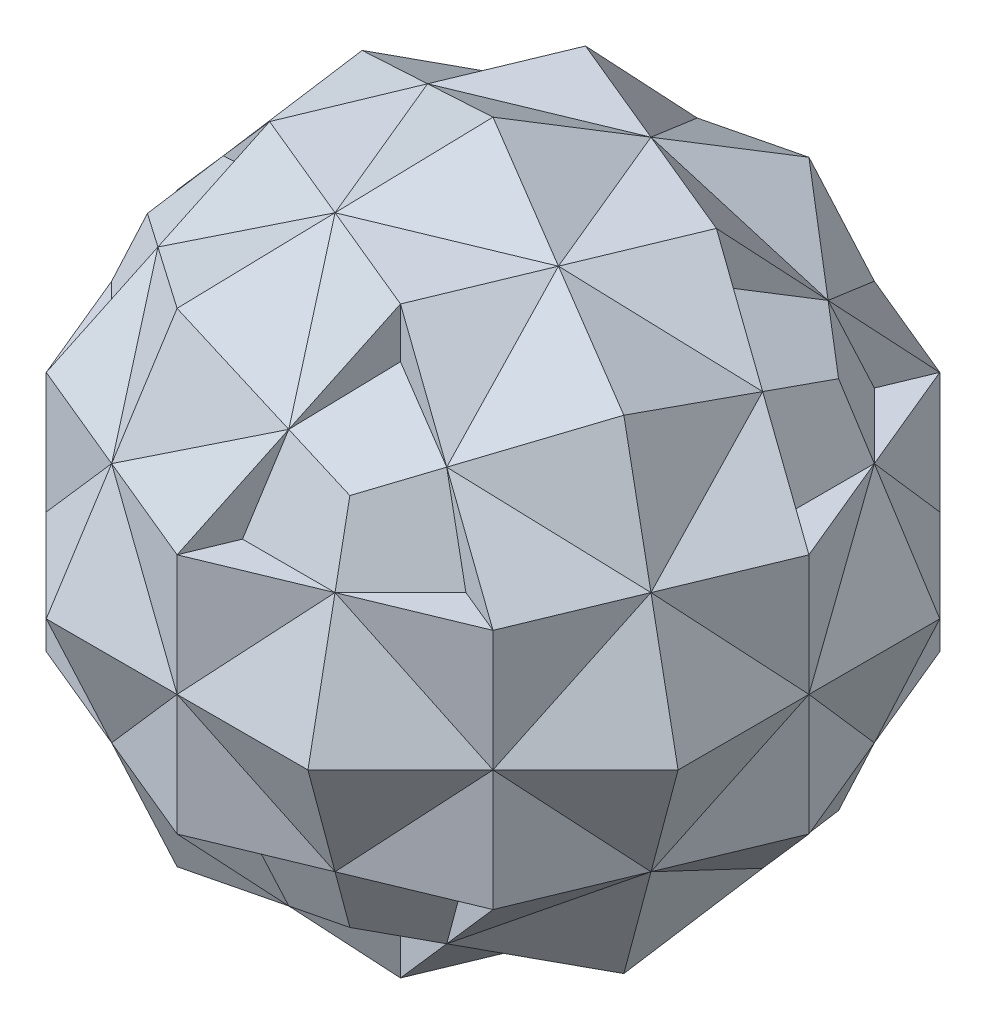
ISO-10303-21;
HEADER;
FILE_DESCRIPTION(('STEP AP214'),'2;1');
FILE_NAME('part.step','',(''),(''),'','','');
FILE_SCHEMA(('AUTOMOTIVE_DESIGN { 1 0 10303 214 1 1 1 1 }'));
ENDSEC;
DATA;
#1=APPLICATION_CONTEXT('core data for automotive mechanical design processes');
#2=APPLICATION_PROTOCOL_DEFINITION('international standard','automotive_design',2000,#1);
#3=PRODUCT_CONTEXT('',#1,'mechanical');
#4=PRODUCT('Part','Part','',(#3));
#5=PRODUCT_RELATED_PRODUCT_CATEGORY('part','',(#4));
#6=PRODUCT_DEFINITION_FORMATION('','',#4);
#7=PRODUCT_DEFINITION_CONTEXT('part definition',#1,'design');
#8=PRODUCT_DEFINITION('design','',#6,#7);
#9=PRODUCT_DEFINITION_SHAPE('','',#8);
#10=(LENGTH_UNIT() NAMED_UNIT(*) SI_UNIT(.MILLI.,.METRE.));
#11=(NAMED_UNIT(*) PLANE_ANGLE_UNIT() SI_UNIT($,.RADIAN.));
#12=(NAMED_UNIT(*) SI_UNIT($,.STERADIAN.) SOLID_ANGLE_UNIT());
#13=UNCERTAINTY_MEASURE_WITH_UNIT(LENGTH_MEASURE(1.E-05),#10,'distance_accuracy_value','');
#14=(GEOMETRIC_REPRESENTATION_CONTEXT(3) GLOBAL_UNCERTAINTY_ASSIGNED_CONTEXT((#13)) GLOBAL_UNIT_ASSIGNED_CONTEXT((#10,
#11,#12)) REPRESENTATION_CONTEXT('',''));
#15=CARTESIAN_POINT('',(0.,0.,0.));
#16=DIRECTION('',(0.,0.,1.));
#17=DIRECTION('',(1.,0.,0.));
#18=AXIS2_PLACEMENT_3D('',#15,#16,#17);
#19=CARTESIAN_POINT('',(-44.680027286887,-40.961563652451,0.829403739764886));
#20=DIRECTION('',(-0.933948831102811,-0.357406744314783,-2.70645488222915E-11));
#21=DIRECTION('',(0.357406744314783,-0.933948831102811,0.));
#22=AXIS2_PLACEMENT_3D('',#19,#20,#21);
#23=PLANE('',#22);
#24=DIRECTION('',(-0.353553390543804,0.923879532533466,0.146446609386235));
#25=VECTOR('',#24,1.);
#26=CARTESIAN_POINT('',(-53.5188620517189,-17.8645753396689,22.1682385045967));
#27=LINE('',#26,#25);
#28=CARTESIAN_POINT('',(-46.6823850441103,-35.7291506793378,19.3364770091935));
#29=VERTEX_POINT('',#28);
#30=CARTESIAN_POINT('',(-60.3553390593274,0.,25.));
#31=VERTEX_POINT('',#30);
#32=EDGE_CURVE('E918',#29,#31,#27,.T.);
#33=ORIENTED_EDGE('',*,*,#32,.T.);
#34=DIRECTION('',(0.,0.,-1.));
#35=VECTOR('',#34,1.);
#36=CARTESIAN_POINT('',(-60.3553390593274,0.,0.));
#37=LINE('',#36,#35);
#38=CARTESIAN_POINT('',(-60.3553390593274,0.,-25.));
#39=VERTEX_POINT('',#38);
#40=EDGE_CURVE('E920',#31,#39,#37,.T.);
#41=ORIENTED_EDGE('',*,*,#40,.T.);
#42=DIRECTION('',(0.353553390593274,-0.923879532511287,0.146446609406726));
#43=VECTOR('',#42,1.);
#44=CARTESIAN_POINT('',(-51.5165042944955,-23.0969883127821,-21.3388347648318));
#45=LINE('',#44,#43);
#46=CARTESIAN_POINT('',(-42.6776695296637,-46.1939766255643,-17.6776695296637));
#47=VERTEX_POINT('',#46);
#48=EDGE_CURVE('E922',#39,#47,#45,.T.);
#49=ORIENTED_EDGE('',*,*,#48,.T.);
#50=DIRECTION('',(-0.103553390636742,0.270598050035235,0.957106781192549));
#51=VECTOR('',#50,1.);
#52=CARTESIAN_POINT('',(-44.680027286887,-40.961563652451,0.829403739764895));
#53=LINE('',#52,#51);
#54=EDGE_CURVE('E695',#47,#29,#53,.T.);
#55=ORIENTED_EDGE('',*,*,#54,.T.);
#56=EDGE_LOOP('',(#33,#41,#49,#55));
#57=FACE_BOUND('',#56,.T.);
#58=ADVANCED_FACE('F692',(#57),#23,.T.);
#59=CARTESIAN_POINT('',(-51.5165042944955,-23.0969883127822,-21.3388347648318));
#60=DIRECTION('',(0.660401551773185,0.357406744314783,0.660401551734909));
#61=DIRECTION('',(0.707106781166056,0.,-0.707106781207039));
#62=AXIS2_PLACEMENT_3D('',#59,#60,#61);
#63=PLANE('',#62);
#64=ORIENTED_EDGE('',*,*,#48,.F.);
#65=DIRECTION('',(-0.707106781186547,0.,0.707106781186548));
#66=VECTOR('',#65,1.);
#67=CARTESIAN_POINT('',(-42.6776695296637,0.,-42.6776695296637));
#68=LINE('',#67,#66);
#69=CARTESIAN_POINT('',(-25.,0.,-60.3553390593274));
#70=VERTEX_POINT('',#69);
#71=EDGE_CURVE('E902',#70,#39,#68,.T.);
#72=ORIENTED_EDGE('',*,*,#71,.F.);
#73=DIRECTION('',(-0.146446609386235,0.923879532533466,-0.353553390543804));
#74=VECTOR('',#73,1.);
#75=CARTESIAN_POINT('',(-22.1682385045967,-17.8645753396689,-53.5188620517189));
#76=LINE('',#75,#74);
#77=CARTESIAN_POINT('',(-19.3364770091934,-35.7291506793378,-46.6823850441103));
#78=VERTEX_POINT('',#77);
#79=EDGE_CURVE('E899',#78,#70,#76,.T.);
#80=ORIENTED_EDGE('',*,*,#79,.F.);
#81=DIRECTION('',(0.603553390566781,0.270598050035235,-0.750000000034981));
#82=VECTOR('',#81,1.);
#83=CARTESIAN_POINT('',(-31.0070732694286,-40.961563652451,-32.180027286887));
#84=LINE('',#83,#82);
#85=EDGE_CURVE('E897',#47,#78,#84,.T.);
#86=ORIENTED_EDGE('',*,*,#85,.F.);
#87=EDGE_LOOP('',(#64,#72,#80,#86));
#88=FACE_BOUND('',#87,.T.);
#89=ADVANCED_FACE('F946',(#88),#63,.F.);
#90=CARTESIAN_POINT('',(21.3388347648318,-23.0969883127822,-51.5165042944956));
#91=DIRECTION('',(-2.70644780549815E-11,0.357406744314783,0.933948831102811));
#92=DIRECTION('',(0.,-0.933948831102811,0.357406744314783));
#93=AXIS2_PLACEMENT_3D('',#90,#91,#92);
#94=PLANE('',#93);
#95=ORIENTED_EDGE('',*,*,#79,.T.);
#96=DIRECTION('',(-1.,0.,0.));
#97=VECTOR('',#96,1.);
#98=CARTESIAN_POINT('',(0.,0.,-60.3553390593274));
#99=LINE('',#98,#97);
#100=CARTESIAN_POINT('',(25.,0.,-60.3553390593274));
#101=VERTEX_POINT('',#100);
#102=EDGE_CURVE('E886',#101,#70,#99,.T.);
#103=ORIENTED_EDGE('',*,*,#102,.F.);
#104=DIRECTION('',(0.146446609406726,0.923879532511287,-0.353553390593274));
#105=VECTOR('',#104,1.);
#106=CARTESIAN_POINT('',(21.3388347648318,-23.0969883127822,-51.5165042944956));
#107=LINE('',#106,#105);
#108=CARTESIAN_POINT('',(17.6776695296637,-46.1939766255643,-42.6776695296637));
#109=VERTEX_POINT('',#108);
#110=EDGE_CURVE('E883',#109,#101,#107,.T.);
#111=ORIENTED_EDGE('',*,*,#110,.F.);
#112=DIRECTION('',(0.95710678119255,-0.270598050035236,0.103553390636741));
#113=VECTOR('',#112,1.);
#114=CARTESIAN_POINT('',(-0.829403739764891,-40.961563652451,-44.680027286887));
#115=LINE('',#114,#113);
#116=EDGE_CURVE('E823',#78,#109,#115,.T.);
#117=ORIENTED_EDGE('',*,*,#116,.F.);
#118=EDGE_LOOP('',(#95,#103,#111,#117));
#119=FACE_BOUND('',#118,.T.);
#120=ADVANCED_FACE('F950',(#119),#94,.F.);
#121=CARTESIAN_POINT('',(21.3388347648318,-23.0969883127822,-51.5165042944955));
#122=DIRECTION('',(-0.66040155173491,0.357406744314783,0.660401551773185));
#123=DIRECTION('',(0.707106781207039,0.,0.707106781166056));
#124=AXIS2_PLACEMENT_3D('',#121,#122,#123);
#125=PLANE('',#124);
#126=ORIENTED_EDGE('',*,*,#110,.T.);
#127=DIRECTION('',(-0.707106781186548,0.,-0.707106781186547));
#128=VECTOR('',#127,1.);
#129=CARTESIAN_POINT('',(42.6776695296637,0.,-42.6776695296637));
#130=LINE('',#129,#128);
#131=CARTESIAN_POINT('',(60.3553390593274,0.,-25.));
#132=VERTEX_POINT('',#131);
#133=EDGE_CURVE('E871',#132,#101,#130,.T.);
#134=ORIENTED_EDGE('',*,*,#133,.F.);
#135=DIRECTION('',(0.353553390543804,0.923879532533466,-0.146446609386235));
#136=VECTOR('',#135,1.);
#137=CARTESIAN_POINT('',(53.5188620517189,-17.8645753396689,-22.1682385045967));
#138=LINE('',#137,#136);
#139=CARTESIAN_POINT('',(46.6823850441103,-35.7291506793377,-19.3364770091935));
#140=VERTEX_POINT('',#139);
#141=EDGE_CURVE('E868',#140,#132,#138,.T.);
#142=ORIENTED_EDGE('',*,*,#141,.F.);
#143=DIRECTION('',(0.75000000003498,0.270598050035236,0.603553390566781));
#144=VECTOR('',#143,1.);
#145=CARTESIAN_POINT('',(32.180027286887,-40.961563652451,-31.0070732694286));
#146=LINE('',#145,#144);
#147=EDGE_CURVE('E865',#109,#140,#146,.T.);
#148=ORIENTED_EDGE('',*,*,#147,.F.);
#149=EDGE_LOOP('',(#126,#134,#142,#148));
#150=FACE_BOUND('',#149,.T.);
#151=ADVANCED_FACE('F953',(#150),#125,.F.);
#152=CARTESIAN_POINT('',(0.,0.,60.3553390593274));
#153=DIRECTION('',(-2.70608610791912E-11,0.357406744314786,0.93394883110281));
#154=DIRECTION('',(0.,-0.93394883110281,0.357406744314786));
#155=AXIS2_PLACEMENT_3D('',#152,#153,#154);
#156=PLANE('',#155);
#157=DIRECTION('',(1.,0.,0.));
#158=VECTOR('',#157,1.);
#159=CARTESIAN_POINT('',(0.,0.,60.3553390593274));
#160=LINE('',#159,#158);
#161=CARTESIAN_POINT('',(-25.,0.,60.3553390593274));
#162=VERTEX_POINT('',#161);
#163=CARTESIAN_POINT('',(25.,0.,60.3553390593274));
#164=VERTEX_POINT('',#163);
#165=EDGE_CURVE('E889',#162,#164,#160,.T.);
#166=ORIENTED_EDGE('',*,*,#165,.T.);
#167=DIRECTION('',(0.146446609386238,-0.923879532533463,0.35355339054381));
#168=VECTOR('',#167,1.);
#169=CARTESIAN_POINT('',(22.1682385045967,17.8645753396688,53.5188620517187));
#170=LINE('',#169,#168);
#171=CARTESIAN_POINT('',(19.3364770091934,35.7291506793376,46.6823850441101));
#172=VERTEX_POINT('',#171);
#173=EDGE_CURVE('E882',#172,#164,#170,.T.);
#174=ORIENTED_EDGE('',*,*,#173,.F.);
#175=DIRECTION('',(-0.957106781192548,0.270598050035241,-0.103553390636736));
#176=VECTOR('',#175,1.);
#177=CARTESIAN_POINT('',(0.829403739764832,40.961563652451,44.6800272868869));
#178=LINE('',#177,#176);
#179=CARTESIAN_POINT('',(-17.6776695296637,46.1939766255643,42.6776695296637));
#180=VERTEX_POINT('',#179);
#181=EDGE_CURVE('E892',#172,#180,#178,.T.);
#182=ORIENTED_EDGE('',*,*,#181,.T.);
#183=DIRECTION('',(-0.146446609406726,-0.923879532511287,0.353553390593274));
#184=VECTOR('',#183,1.);
#185=CARTESIAN_POINT('',(-21.3388347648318,23.0969883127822,51.5165042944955));
#186=LINE('',#185,#184);
#187=EDGE_CURVE('E867',#180,#162,#186,.T.);
#188=ORIENTED_EDGE('',*,*,#187,.T.);
#189=EDGE_LOOP('',(#166,#174,#182,#188));
#190=FACE_BOUND('',#189,.T.);
#191=ADVANCED_FACE('F977',(#190),#156,.T.);
#192=CARTESIAN_POINT('',(-53.5188620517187,17.8645753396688,22.1682385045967));
#193=DIRECTION('',(-0.660401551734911,0.357406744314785,0.660401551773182));
#194=DIRECTION('',(0.707106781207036,0.,0.707106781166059));
#195=AXIS2_PLACEMENT_3D('',#192,#193,#194);
#196=PLANE('',#195);
#197=DIRECTION('',(0.707106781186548,0.,0.707106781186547));
#198=VECTOR('',#197,1.);
#199=CARTESIAN_POINT('',(-42.6776695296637,0.,42.6776695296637));
#200=LINE('',#199,#198);
#201=EDGE_CURVE('E873',#31,#162,#200,.T.);
#202=ORIENTED_EDGE('',*,*,#201,.T.);
#203=ORIENTED_EDGE('',*,*,#187,.F.);
#204=DIRECTION('',(-0.750000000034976,-0.270598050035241,-0.603553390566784));
#205=VECTOR('',#204,1.);
#206=CARTESIAN_POINT('',(-32.1800272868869,40.961563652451,31.0070732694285));
#207=LINE('',#206,#205);
#208=CARTESIAN_POINT('',(-46.6823850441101,35.7291506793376,19.3364770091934));
#209=VERTEX_POINT('',#208);
#210=EDGE_CURVE('E876',#180,#209,#207,.T.);
#211=ORIENTED_EDGE('',*,*,#210,.T.);
#212=DIRECTION('',(-0.35355339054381,-0.923879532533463,0.146446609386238));
#213=VECTOR('',#212,1.);
#214=CARTESIAN_POINT('',(-53.5188620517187,17.8645753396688,22.1682385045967));
#215=LINE('',#214,#213);
#216=EDGE_CURVE('E857',#209,#31,#215,.T.);
#217=ORIENTED_EDGE('',*,*,#216,.T.);
#218=EDGE_LOOP('',(#202,#203,#211,#217));
#219=FACE_BOUND('',#218,.T.);
#220=ADVANCED_FACE('F933',(#219),#196,.T.);
#221=CARTESIAN_POINT('',(22.1682385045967,17.8645753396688,53.5188620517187));
#222=DIRECTION('',(0.660401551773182,0.357406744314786,0.660401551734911));
#223=DIRECTION('',(0.707106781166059,0.,-0.707106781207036));
#224=AXIS2_PLACEMENT_3D('',#221,#222,#223);
#225=PLANE('',#224);
#226=DIRECTION('',(0.707106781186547,0.,-0.707106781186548));
#227=VECTOR('',#226,1.);
#228=CARTESIAN_POINT('',(42.6776695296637,0.,42.6776695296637));
#229=LINE('',#228,#227);
#230=CARTESIAN_POINT('',(60.3553390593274,0.,25.));
#231=VERTEX_POINT('',#230);
#232=EDGE_CURVE('E904',#164,#231,#229,.T.);
#233=ORIENTED_EDGE('',*,*,#232,.T.);
#234=DIRECTION('',(-0.353553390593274,0.923879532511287,-0.146446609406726));
#235=VECTOR('',#234,1.);
#236=CARTESIAN_POINT('',(51.5165042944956,23.0969883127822,21.3388347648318));
#237=LINE('',#236,#235);
#238=CARTESIAN_POINT('',(42.6776695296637,46.1939766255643,17.6776695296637));
#239=VERTEX_POINT('',#238);
#240=EDGE_CURVE('E13',#231,#239,#237,.T.);
#241=ORIENTED_EDGE('',*,*,#240,.T.);
#242=DIRECTION('',(-0.603553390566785,-0.27059805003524,0.750000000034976));
#243=VECTOR('',#242,1.);
#244=CARTESIAN_POINT('',(31.0070732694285,40.9615636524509,32.1800272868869));
#245=LINE('',#244,#243);
#246=EDGE_CURVE('E907',#239,#172,#245,.T.);
#247=ORIENTED_EDGE('',*,*,#246,.T.);
#248=ORIENTED_EDGE('',*,*,#173,.T.);
#249=EDGE_LOOP('',(#233,#241,#247,#248));
#250=FACE_BOUND('',#249,.T.);
#251=ADVANCED_FACE('F976',(#250),#225,.T.);
#252=CARTESIAN_POINT('',(60.3553390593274,0.,0.));
#253=DIRECTION('',(-0.933948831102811,-0.357406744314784,-2.70630045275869E-11));
#254=DIRECTION('',(0.357406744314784,-0.933948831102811,0.));
#255=AXIS2_PLACEMENT_3D('',#252,#253,#254);
#256=PLANE('',#255);
#257=DIRECTION('',(0.,0.,1.));
#258=VECTOR('',#257,1.);
#259=CARTESIAN_POINT('',(60.3553390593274,0.,0.));
#260=LINE('',#259,#258);
#261=EDGE_CURVE('E916',#132,#231,#260,.T.);
#262=ORIENTED_EDGE('',*,*,#261,.F.);
#263=DIRECTION('',(0.353553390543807,-0.923879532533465,-0.146446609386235));
#264=VECTOR('',#263,1.);
#265=CARTESIAN_POINT('',(53.5188620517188,17.8645753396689,-22.1682385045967));
#266=LINE('',#265,#264);
#267=CARTESIAN_POINT('',(46.6823850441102,35.7291506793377,-19.3364770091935));
#268=VERTEX_POINT('',#267);
#269=EDGE_CURVE('E914',#268,#132,#266,.T.);
#270=ORIENTED_EDGE('',*,*,#269,.F.);
#271=DIRECTION('',(0.103553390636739,-0.270598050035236,-0.95710678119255));
#272=VECTOR('',#271,1.);
#273=CARTESIAN_POINT('',(44.680027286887,40.961563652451,-0.829403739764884));
#274=LINE('',#273,#272);
#275=EDGE_CURVE('E700',#239,#268,#274,.T.);
#276=ORIENTED_EDGE('',*,*,#275,.F.);
#277=ORIENTED_EDGE('',*,*,#240,.F.);
#278=EDGE_LOOP('',(#262,#270,#276,#277));
#279=FACE_BOUND('',#278,.T.);
#280=ADVANCED_FACE('F964',(#279),#256,.F.);
#281=CARTESIAN_POINT('',(-51.5165042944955,23.0969883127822,-21.3388347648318));
#282=DIRECTION('',(-0.93394883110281,0.357406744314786,-2.70611267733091E-11));
#283=DIRECTION('',(-0.357406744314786,-0.93394883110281,0.));
#284=AXIS2_PLACEMENT_3D('',#281,#282,#283);
#285=PLANE('',#284);
#286=ORIENTED_EDGE('',*,*,#40,.F.);
#287=ORIENTED_EDGE('',*,*,#216,.F.);
#288=DIRECTION('',(0.103553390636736,0.27059805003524,-0.957106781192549));
#289=VECTOR('',#288,1.);
#290=CARTESIAN_POINT('',(-44.6800272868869,40.961563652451,0.829403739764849));
#291=LINE('',#290,#289);
#292=CARTESIAN_POINT('',(-42.6776695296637,46.1939766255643,-17.6776695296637));
#293=VERTEX_POINT('',#292);
#294=EDGE_CURVE('E860',#209,#293,#291,.T.);
#295=ORIENTED_EDGE('',*,*,#294,.T.);
#296=DIRECTION('',(-0.353553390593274,-0.923879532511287,-0.146446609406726));
#297=VECTOR('',#296,1.);
#298=CARTESIAN_POINT('',(-51.5165042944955,23.0969883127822,-21.3388347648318));
#299=LINE('',#298,#297);
#300=EDGE_CURVE('E848',#293,#39,#299,.T.);
#301=ORIENTED_EDGE('',*,*,#300,.T.);
#302=EDGE_LOOP('',(#286,#287,#295,#301));
#303=FACE_BOUND('',#302,.T.);
#304=ADVANCED_FACE('F938',(#303),#285,.T.);
#305=CARTESIAN_POINT('',(60.3553390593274,0.,0.));
#306=DIRECTION('',(-0.933948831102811,0.357406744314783,-2.70643935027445E-11));
#307=DIRECTION('',(-0.357406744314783,-0.933948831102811,0.));
#308=AXIS2_PLACEMENT_3D('',#305,#306,#307);
#309=PLANE('',#308);
#310=ORIENTED_EDGE('',*,*,#141,.T.);
#311=ORIENTED_EDGE('',*,*,#261,.T.);
#312=DIRECTION('',(0.353553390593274,0.923879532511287,0.146446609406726));
#313=VECTOR('',#312,1.);
#314=CARTESIAN_POINT('',(51.5165042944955,-23.0969883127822,21.3388347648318));
#315=LINE('',#314,#313);
#316=CARTESIAN_POINT('',(42.6776695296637,-46.1939766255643,17.6776695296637));
#317=VERTEX_POINT('',#316);
#318=EDGE_CURVE('E858',#317,#231,#315,.T.);
#319=ORIENTED_EDGE('',*,*,#318,.F.);
#320=DIRECTION('',(-0.103553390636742,-0.270598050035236,0.957106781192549));
#321=VECTOR('',#320,1.);
#322=CARTESIAN_POINT('',(44.680027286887,-40.961563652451,-0.829403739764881));
#323=LINE('',#322,#321);
#324=EDGE_CURVE('E798',#140,#317,#323,.T.);
#325=ORIENTED_EDGE('',*,*,#324,.F.);
#326=EDGE_LOOP('',(#310,#311,#319,#325));
#327=FACE_BOUND('',#326,.T.);
#328=ADVANCED_FACE('F982',(#327),#309,.F.);
#329=CARTESIAN_POINT('',(42.6776695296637,0.,42.6776695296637));
#330=DIRECTION('',(-0.660401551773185,0.357406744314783,-0.66040155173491));
#331=DIRECTION('',(-0.707106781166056,0.,0.707106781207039));
#332=AXIS2_PLACEMENT_3D('',#329,#330,#331);
#333=PLANE('',#332);
#334=ORIENTED_EDGE('',*,*,#318,.T.);
#335=ORIENTED_EDGE('',*,*,#232,.F.);
#336=DIRECTION('',(0.146446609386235,0.923879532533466,0.353553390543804));
#337=VECTOR('',#336,1.);
#338=CARTESIAN_POINT('',(22.1682385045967,-17.8645753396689,53.5188620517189));
#339=LINE('',#338,#337);
#340=CARTESIAN_POINT('',(19.3364770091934,-35.7291506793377,46.6823850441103));
#341=VERTEX_POINT('',#340);
#342=EDGE_CURVE('E849',#341,#164,#339,.T.);
#343=ORIENTED_EDGE('',*,*,#342,.F.);
#344=DIRECTION('',(-0.603553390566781,0.270598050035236,0.75000000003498));
#345=VECTOR('',#344,1.);
#346=CARTESIAN_POINT('',(31.0070732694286,-40.961563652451,32.180027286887));
#347=LINE('',#346,#345);
#348=EDGE_CURVE('E716',#317,#341,#347,.T.);
#349=ORIENTED_EDGE('',*,*,#348,.F.);
#350=EDGE_LOOP('',(#334,#335,#343,#349));
#351=FACE_BOUND('',#350,.T.);
#352=ADVANCED_FACE('F980',(#351),#333,.F.);
#353=CARTESIAN_POINT('',(-31.0070732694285,40.961563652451,-32.1800272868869));
#354=DIRECTION('',(-0.660401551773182,0.357406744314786,-0.660401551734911));
#355=DIRECTION('',(-0.707106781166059,0.,0.707106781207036));
#356=AXIS2_PLACEMENT_3D('',#353,#354,#355);
#357=PLANE('',#356);
#358=ORIENTED_EDGE('',*,*,#71,.T.);
#359=ORIENTED_EDGE('',*,*,#300,.F.);
#360=DIRECTION('',(0.603553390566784,-0.27059805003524,-0.750000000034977));
#361=VECTOR('',#360,1.);
#362=CARTESIAN_POINT('',(-31.0070732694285,40.961563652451,-32.1800272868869));
#363=LINE('',#362,#361);
#364=CARTESIAN_POINT('',(-19.3364770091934,35.7291506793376,-46.6823850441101));
#365=VERTEX_POINT('',#364);
#366=EDGE_CURVE('E852',#293,#365,#363,.T.);
#367=ORIENTED_EDGE('',*,*,#366,.T.);
#368=DIRECTION('',(-0.146446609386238,-0.923879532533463,-0.35355339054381));
#369=VECTOR('',#368,1.);
#370=CARTESIAN_POINT('',(-22.1682385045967,17.8645753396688,-53.5188620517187));
#371=LINE('',#370,#369);
#372=EDGE_CURVE('E838',#365,#70,#371,.T.);
#373=ORIENTED_EDGE('',*,*,#372,.T.);
#374=EDGE_LOOP('',(#358,#359,#367,#373));
#375=FACE_BOUND('',#374,.T.);
#376=ADVANCED_FACE('F941',(#375),#357,.T.);
#377=CARTESIAN_POINT('',(21.3388347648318,23.0969883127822,-51.5165042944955));
#378=DIRECTION('',(2.70613215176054E-11,0.357406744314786,-0.93394883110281));
#379=DIRECTION('',(0.,0.93394883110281,0.357406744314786));
#380=AXIS2_PLACEMENT_3D('',#377,#378,#379);
#381=PLANE('',#380);
#382=ORIENTED_EDGE('',*,*,#102,.T.);
#383=ORIENTED_EDGE('',*,*,#372,.F.);
#384=DIRECTION('',(0.957106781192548,0.270598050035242,0.103553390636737));
#385=VECTOR('',#384,1.);
#386=CARTESIAN_POINT('',(-0.829403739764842,40.961563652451,-44.6800272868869));
#387=LINE('',#386,#385);
#388=CARTESIAN_POINT('',(17.6776695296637,46.1939766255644,-42.6776695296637));
#389=VERTEX_POINT('',#388);
#390=EDGE_CURVE('E842',#365,#389,#387,.T.);
#391=ORIENTED_EDGE('',*,*,#390,.T.);
#392=DIRECTION('',(0.146446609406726,-0.923879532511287,-0.353553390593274));
#393=VECTOR('',#392,1.);
#394=CARTESIAN_POINT('',(21.3388347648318,23.0969883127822,-51.5165042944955));
#395=LINE('',#394,#393);
#396=EDGE_CURVE('E835',#389,#101,#395,.T.);
#397=ORIENTED_EDGE('',*,*,#396,.T.);
#398=EDGE_LOOP('',(#382,#383,#391,#397));
#399=FACE_BOUND('',#398,.T.);
#400=ADVANCED_FACE('F957',(#399),#381,.T.);
#401=CARTESIAN_POINT('',(22.1682385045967,-17.8645753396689,53.5188620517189));
#402=DIRECTION('',(2.70641781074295E-11,0.357406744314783,-0.933948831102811));
#403=DIRECTION('',(0.,0.933948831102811,0.357406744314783));
#404=AXIS2_PLACEMENT_3D('',#401,#402,#403);
#405=PLANE('',#404);
#406=ORIENTED_EDGE('',*,*,#342,.T.);
#407=ORIENTED_EDGE('',*,*,#165,.F.);
#408=DIRECTION('',(-0.146446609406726,0.923879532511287,0.353553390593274));
#409=VECTOR('',#408,1.);
#410=CARTESIAN_POINT('',(-21.3388347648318,-23.0969883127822,51.5165042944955));
#411=LINE('',#410,#409);
#412=CARTESIAN_POINT('',(-17.6776695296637,-46.1939766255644,42.6776695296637));
#413=VERTEX_POINT('',#412);
#414=EDGE_CURVE('E839',#413,#162,#411,.T.);
#415=ORIENTED_EDGE('',*,*,#414,.F.);
#416=DIRECTION('',(-0.957106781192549,-0.270598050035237,-0.103553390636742));
#417=VECTOR('',#416,1.);
#418=CARTESIAN_POINT('',(0.829403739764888,-40.961563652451,44.680027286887));
#419=LINE('',#418,#417);
#420=EDGE_CURVE('E818',#341,#413,#419,.T.);
#421=ORIENTED_EDGE('',*,*,#420,.F.);
#422=EDGE_LOOP('',(#406,#407,#415,#421));
#423=FACE_BOUND('',#422,.T.);
#424=ADVANCED_FACE('F979',(#423),#405,.F.);
#425=CARTESIAN_POINT('',(-21.3388347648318,-23.0969883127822,51.5165042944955));
#426=DIRECTION('',(0.66040155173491,0.357406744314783,-0.660401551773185));
#427=DIRECTION('',(-0.707106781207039,0.,-0.707106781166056));
#428=AXIS2_PLACEMENT_3D('',#425,#426,#427);
#429=PLANE('',#428);
#430=ORIENTED_EDGE('',*,*,#414,.T.);
#431=ORIENTED_EDGE('',*,*,#201,.F.);
#432=ORIENTED_EDGE('',*,*,#32,.F.);
#433=DIRECTION('',(-0.750000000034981,0.270598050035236,-0.60355339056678));
#434=VECTOR('',#433,1.);
#435=CARTESIAN_POINT('',(-32.180027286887,-40.9615636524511,31.0070732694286));
#436=LINE('',#435,#434);
#437=EDGE_CURVE('E833',#413,#29,#436,.T.);
#438=ORIENTED_EDGE('',*,*,#437,.F.);
#439=EDGE_LOOP('',(#430,#431,#432,#438));
#440=FACE_BOUND('',#439,.T.);
#441=ADVANCED_FACE('F930',(#440),#429,.F.);
#442=CARTESIAN_POINT('',(32.1800272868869,40.961563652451,-31.0070732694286));
#443=DIRECTION('',(0.66040155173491,0.357406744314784,-0.660401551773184));
#444=DIRECTION('',(-0.707106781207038,0.,-0.707106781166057));
#445=AXIS2_PLACEMENT_3D('',#442,#443,#444);
#446=PLANE('',#445);
#447=ORIENTED_EDGE('',*,*,#133,.T.);
#448=ORIENTED_EDGE('',*,*,#396,.F.);
#449=DIRECTION('',(0.75000000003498,-0.270598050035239,0.603553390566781));
#450=VECTOR('',#449,1.);
#451=CARTESIAN_POINT('',(32.180027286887,40.961563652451,-31.0070732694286));
#452=LINE('',#451,#450);
#453=EDGE_CURVE('E819',#389,#268,#452,.T.);
#454=ORIENTED_EDGE('',*,*,#453,.T.);
#455=ORIENTED_EDGE('',*,*,#269,.T.);
#456=EDGE_LOOP('',(#447,#448,#454,#455));
#457=FACE_BOUND('',#456,.T.);
#458=ADVANCED_FACE('F960',(#457),#446,.T.);
#459=CARTESIAN_POINT('',(44.680027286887,40.961563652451,-0.829403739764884));
#460=DIRECTION('',(0.466974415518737,0.862856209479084,-0.19342713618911));
#461=DIRECTION('',(-0.879465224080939,0.475963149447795,0.));
#462=AXIS2_PLACEMENT_3D('',#459,#460,#461);
#463=PLANE('',#462);
#464=ORIENTED_EDGE('',*,*,#275,.T.);
#465=ORIENTED_EDGE('',*,*,#453,.F.);
#466=DIRECTION('',(-0.353553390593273,0.38268343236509,0.853553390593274));
#467=VECTOR('',#466,1.);
#468=CARTESIAN_POINT('',(8.83883476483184,55.7610624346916,-21.3388347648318));
#469=LINE('',#468,#467);
#470=CARTESIAN_POINT('',(0.,65.3281482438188,0.));
#471=VERTEX_POINT('',#470);
#472=EDGE_CURVE('E814',#389,#471,#469,.T.);
#473=ORIENTED_EDGE('',*,*,#472,.T.);
#474=DIRECTION('',(0.853553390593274,-0.38268343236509,0.353553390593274));
#475=VECTOR('',#474,1.);
#476=CARTESIAN_POINT('',(21.3388347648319,55.7610624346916,8.83883476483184));
#477=LINE('',#476,#475);
#478=EDGE_CURVE('E708',#471,#239,#477,.T.);
#479=ORIENTED_EDGE('',*,*,#478,.T.);
#480=EDGE_LOOP('',(#464,#465,#473,#479));
#481=FACE_BOUND('',#480,.T.);
#482=ADVANCED_FACE('F967',(#481),#463,.T.);
#483=CARTESIAN_POINT('',(-32.180027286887,-40.9615636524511,31.0070732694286));
#484=DIRECTION('',(0.466974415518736,0.862856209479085,-0.193427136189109));
#485=DIRECTION('',(-0.87946522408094,0.475963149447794,0.));
#486=AXIS2_PLACEMENT_3D('',#483,#484,#485);
#487=PLANE('',#486);
#488=ORIENTED_EDGE('',*,*,#437,.T.);
#489=ORIENTED_EDGE('',*,*,#54,.F.);
#490=DIRECTION('',(-0.853553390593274,0.38268343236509,-0.353553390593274));
#491=VECTOR('',#490,1.);
#492=CARTESIAN_POINT('',(-21.3388347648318,-55.7610624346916,-8.83883476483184));
#493=LINE('',#492,#491);
#494=CARTESIAN_POINT('',(0.,-65.3281482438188,0.));
#495=VERTEX_POINT('',#494);
#496=EDGE_CURVE('E807',#495,#47,#493,.T.);
#497=ORIENTED_EDGE('',*,*,#496,.F.);
#498=DIRECTION('',(0.353553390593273,-0.38268343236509,-0.853553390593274));
#499=VECTOR('',#498,1.);
#500=CARTESIAN_POINT('',(-8.83883476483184,-55.7610624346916,21.3388347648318));
#501=LINE('',#500,#499);
#502=EDGE_CURVE('E810',#413,#495,#501,.T.);
#503=ORIENTED_EDGE('',*,*,#502,.F.);
#504=EDGE_LOOP('',(#488,#489,#497,#503));
#505=FACE_BOUND('',#504,.T.);
#506=ADVANCED_FACE('F809',(#505),#487,.F.);
#507=CARTESIAN_POINT('',(0.829403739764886,-40.961563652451,44.680027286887));
#508=DIRECTION('',(-0.19342713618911,0.862856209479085,-0.466974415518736));
#509=DIRECTION('',(0.,0.475963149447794,0.87946522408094));
#510=AXIS2_PLACEMENT_3D('',#507,#508,#509);
#511=PLANE('',#510);
#512=ORIENTED_EDGE('',*,*,#420,.T.);
#513=ORIENTED_EDGE('',*,*,#502,.T.);
#514=DIRECTION('',(-0.853553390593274,-0.38268343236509,-0.353553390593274));
#515=VECTOR('',#514,1.);
#516=CARTESIAN_POINT('',(21.3388347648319,-55.7610624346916,8.83883476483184));
#517=LINE('',#516,#515);
#518=EDGE_CURVE('E790',#317,#495,#517,.T.);
#519=ORIENTED_EDGE('',*,*,#518,.F.);
#520=ORIENTED_EDGE('',*,*,#348,.T.);
#521=EDGE_LOOP('',(#512,#513,#519,#520));
#522=FACE_BOUND('',#521,.T.);
#523=ADVANCED_FACE('F816',(#522),#511,.F.);
#524=CARTESIAN_POINT('',(-21.3388347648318,55.7610624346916,-8.83883476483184));
#525=DIRECTION('',(-0.193427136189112,0.862856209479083,-0.466974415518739));
#526=DIRECTION('',(0.,0.475963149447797,0.879465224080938));
#527=AXIS2_PLACEMENT_3D('',#524,#525,#526);
#528=PLANE('',#527);
#529=ORIENTED_EDGE('',*,*,#390,.F.);
#530=ORIENTED_EDGE('',*,*,#366,.F.);
#531=DIRECTION('',(0.853553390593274,0.38268343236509,0.353553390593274));
#532=VECTOR('',#531,1.);
#533=CARTESIAN_POINT('',(-21.3388347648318,55.7610624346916,-8.83883476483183));
#534=LINE('',#533,#532);
#535=EDGE_CURVE('E801',#293,#471,#534,.T.);
#536=ORIENTED_EDGE('',*,*,#535,.T.);
#537=ORIENTED_EDGE('',*,*,#472,.F.);
#538=EDGE_LOOP('',(#529,#530,#536,#537));
#539=FACE_BOUND('',#538,.T.);
#540=ADVANCED_FACE('F969',(#539),#528,.T.);
#541=CARTESIAN_POINT('',(-21.3388347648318,55.7610624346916,-8.83883476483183));
#542=DIRECTION('',(-0.466974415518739,0.862856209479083,0.193427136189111));
#543=DIRECTION('',(-0.879465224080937,-0.475963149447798,0.));
#544=AXIS2_PLACEMENT_3D('',#541,#542,#543);
#545=PLANE('',#544);
#546=ORIENTED_EDGE('',*,*,#294,.F.);
#547=ORIENTED_EDGE('',*,*,#210,.F.);
#548=DIRECTION('',(0.353553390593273,0.38268343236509,-0.853553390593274));
#549=VECTOR('',#548,1.);
#550=CARTESIAN_POINT('',(-8.83883476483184,55.7610624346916,21.3388347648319));
#551=LINE('',#550,#549);
#552=EDGE_CURVE('E824',#180,#471,#551,.T.);
#553=ORIENTED_EDGE('',*,*,#552,.T.);
#554=ORIENTED_EDGE('',*,*,#535,.F.);
#555=EDGE_LOOP('',(#546,#547,#553,#554));
#556=FACE_BOUND('',#555,.T.);
#557=ADVANCED_FACE('F971',(#556),#545,.T.);
#558=CARTESIAN_POINT('',(21.3388347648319,-55.7610624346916,8.83883476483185));
#559=DIRECTION('',(-0.466974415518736,0.862856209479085,0.19342713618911));
#560=DIRECTION('',(-0.879465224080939,-0.475963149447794,0.));
#561=AXIS2_PLACEMENT_3D('',#558,#559,#560);
#562=PLANE('',#561);
#563=ORIENTED_EDGE('',*,*,#324,.T.);
#564=ORIENTED_EDGE('',*,*,#518,.T.);
#565=DIRECTION('',(-0.353553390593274,-0.38268343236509,0.853553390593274));
#566=VECTOR('',#565,1.);
#567=CARTESIAN_POINT('',(8.83883476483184,-55.7610624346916,-21.3388347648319));
#568=LINE('',#567,#566);
#569=EDGE_CURVE('E795',#109,#495,#568,.T.);
#570=ORIENTED_EDGE('',*,*,#569,.F.);
#571=ORIENTED_EDGE('',*,*,#147,.T.);
#572=EDGE_LOOP('',(#563,#564,#570,#571));
#573=FACE_BOUND('',#572,.T.);
#574=ADVANCED_FACE('F792',(#573),#562,.F.);
#575=CARTESIAN_POINT('',(-31.0070732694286,-40.961563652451,-32.180027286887));
#576=DIRECTION('',(0.19342713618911,0.862856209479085,0.466974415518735));
#577=DIRECTION('',(0.,-0.475963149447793,0.87946522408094));
#578=AXIS2_PLACEMENT_3D('',#575,#576,#577);
#579=PLANE('',#578);
#580=ORIENTED_EDGE('',*,*,#116,.T.);
#581=ORIENTED_EDGE('',*,*,#569,.T.);
#582=ORIENTED_EDGE('',*,*,#496,.T.);
#583=ORIENTED_EDGE('',*,*,#85,.T.);
#584=EDGE_LOOP('',(#580,#581,#582,#583));
#585=FACE_BOUND('',#584,.T.);
#586=ADVANCED_FACE('F821',(#585),#579,.F.);
#587=CARTESIAN_POINT('',(21.3388347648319,55.7610624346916,8.83883476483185));
#588=DIRECTION('',(0.193427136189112,0.862856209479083,0.466974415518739));
#589=DIRECTION('',(0.,-0.475963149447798,0.879465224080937));
#590=AXIS2_PLACEMENT_3D('',#587,#588,#589);
#591=PLANE('',#590);
#592=ORIENTED_EDGE('',*,*,#552,.F.);
#593=ORIENTED_EDGE('',*,*,#181,.F.);
#594=ORIENTED_EDGE('',*,*,#246,.F.);
#595=ORIENTED_EDGE('',*,*,#478,.F.);
#596=EDGE_LOOP('',(#592,#593,#594,#595));
#597=FACE_BOUND('',#596,.T.);
#598=ADVANCED_FACE('F972',(#597),#591,.T.);
#599=CLOSED_SHELL('',(#58,#89,#120,#151,#191,#220,#251,#280,#304,#328,#352,#376,#400,#424,#441,
#458,#482,#506,#523,#540,#557,#574,#586,#598));
#600=MANIFOLD_SOLID_BREP('B2',#599);
#601=CARTESIAN_POINT('',(0.,23.096988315,0.));
#602=DIRECTION('',(0.,1.,0.));
#603=DIRECTION('',(0.,0.,1.));
#604=AXIS2_PLACEMENT_3D('',#601,#602,#603);
#605=PLANE('',#604);
#606=DIRECTION('',(-0.38268343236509,0.,0.923879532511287));
#607=VECTOR('',#606,1.);
#608=CARTESIAN_POINT('',(21.3388347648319,23.096988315,8.83883476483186));
#609=LINE('',#608,#607);
#610=CARTESIAN_POINT('',(42.6776695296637,23.096988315,-42.6776695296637));
#611=VERTEX_POINT('',#610);
#612=CARTESIAN_POINT('',(30.1776695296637,23.096988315,-12.5));
#613=VERTEX_POINT('',#612);
#614=EDGE_CURVE('E1354',#611,#613,#609,.T.);
#615=ORIENTED_EDGE('',*,*,#614,.T.);
#616=DIRECTION('',(0.923879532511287,0.,0.38268343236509));
#617=VECTOR('',#616,1.);
#618=CARTESIAN_POINT('',(8.83883476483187,23.096988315,-21.3388347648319));
#619=LINE('',#618,#617);
#620=CARTESIAN_POINT('',(60.3553390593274,23.096988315,0.));
#621=VERTEX_POINT('',#620);
#622=EDGE_CURVE('E1467',#613,#621,#619,.T.);
#623=ORIENTED_EDGE('',*,*,#622,.T.);
#624=DIRECTION('',(-0.382683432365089,0.,-0.923879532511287));
#625=VECTOR('',#624,1.);
#626=CARTESIAN_POINT('',(60.3553390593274,23.096988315,0.));
#627=LINE('',#626,#625);
#628=EDGE_CURVE('E1347',#621,#611,#627,.T.);
#629=ORIENTED_EDGE('',*,*,#628,.T.);
#630=EDGE_LOOP('',(#615,#623,#629));
#631=FACE_BOUND('',#630,.T.);
#632=ADVANCED_FACE('F1175',(#631),#605,.T.);
#633=CARTESIAN_POINT('',(0.,-23.096988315,0.));
#634=DIRECTION('',(0.,1.,0.));
#635=DIRECTION('',(0.,0.,1.));
#636=AXIS2_PLACEMENT_3D('',#633,#634,#635);
#637=PLANE('',#636);
#638=DIRECTION('',(0.923879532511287,0.,0.38268343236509));
#639=VECTOR('',#638,1.);
#640=CARTESIAN_POINT('',(8.83883476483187,-23.096988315,-21.3388347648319));
#641=LINE('',#640,#639);
#642=CARTESIAN_POINT('',(30.1776695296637,-23.0969883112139,-12.5));
#643=VERTEX_POINT('',#642);
#644=CARTESIAN_POINT('',(60.3553390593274,-23.096988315,0.));
#645=VERTEX_POINT('',#644);
#646=EDGE_CURVE('E1320',#643,#645,#641,.T.);
#647=ORIENTED_EDGE('',*,*,#646,.F.);
#648=DIRECTION('',(-0.38268343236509,0.,0.923879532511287));
#649=VECTOR('',#648,1.);
#650=CARTESIAN_POINT('',(21.3388347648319,-23.096988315,8.83883476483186));
#651=LINE('',#650,#649);
#652=CARTESIAN_POINT('',(42.6776695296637,-23.096988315,-42.6776695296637));
#653=VERTEX_POINT('',#652);
#654=EDGE_CURVE('E1393',#653,#643,#651,.T.);
#655=ORIENTED_EDGE('',*,*,#654,.F.);
#656=DIRECTION('',(-0.382683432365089,0.,-0.923879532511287));
#657=VECTOR('',#656,1.);
#658=CARTESIAN_POINT('',(60.3553390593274,-23.096988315,0.));
#659=LINE('',#658,#657);
#660=EDGE_CURVE('E1368',#645,#653,#659,.T.);
#661=ORIENTED_EDGE('',*,*,#660,.F.);
#662=EDGE_LOOP('',(#647,#655,#661));
#663=FACE_BOUND('',#662,.T.);
#664=ADVANCED_FACE('F1560',(#663),#637,.F.);
#665=DIRECTION('',(-0.923879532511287,0.,0.382683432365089));
#666=VECTOR('',#665,1.);
#667=CARTESIAN_POINT('',(0.,23.096988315,-60.3553390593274));
#668=LINE('',#667,#666);
#669=CARTESIAN_POINT('',(0.,23.096988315,-60.3553390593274));
#670=VERTEX_POINT('',#669);
#671=CARTESIAN_POINT('',(-42.6776695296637,23.096988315,-42.6776695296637));
#672=VERTEX_POINT('',#671);
#673=EDGE_CURVE('E1310',#670,#672,#668,.T.);
#674=ORIENTED_EDGE('',*,*,#673,.T.);
#675=DIRECTION('',(0.923879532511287,0.,0.38268343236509));
#676=VECTOR('',#675,1.);
#677=CARTESIAN_POINT('',(8.83883476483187,23.096988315,-21.3388347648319));
#678=LINE('',#677,#676);
#679=CARTESIAN_POINT('',(-12.5,23.0969883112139,-30.1776695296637));
#680=VERTEX_POINT('',#679);
#681=EDGE_CURVE('E1455',#672,#680,#678,.T.);
#682=ORIENTED_EDGE('',*,*,#681,.T.);
#683=DIRECTION('',(-0.38268343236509,0.,0.923879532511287));
#684=VECTOR('',#683,1.);
#685=CARTESIAN_POINT('',(-21.3388347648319,23.096988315,-8.83883476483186));
#686=LINE('',#685,#684);
#687=EDGE_CURVE('E1402',#670,#680,#686,.T.);
#688=ORIENTED_EDGE('',*,*,#687,.F.);
#689=EDGE_LOOP('',(#674,#682,#688));
#690=FACE_BOUND('',#689,.T.);
#691=ADVANCED_FACE('F1454',(#690),#605,.T.);
#692=DIRECTION('',(0.923879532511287,0.,0.38268343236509));
#693=VECTOR('',#692,1.);
#694=CARTESIAN_POINT('',(8.83883476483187,-23.096988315,-21.3388347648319));
#695=LINE('',#694,#693);
#696=CARTESIAN_POINT('',(-42.6776695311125,-23.096988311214,-42.6776695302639));
#697=VERTEX_POINT('',#696);
#698=CARTESIAN_POINT('',(-12.5,-23.096988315,-30.1776695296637));
#699=VERTEX_POINT('',#698);
#700=EDGE_CURVE('E1198',#697,#699,#695,.T.);
#701=ORIENTED_EDGE('',*,*,#700,.F.);
#702=DIRECTION('',(-0.923879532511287,0.,0.382683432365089));
#703=VECTOR('',#702,1.);
#704=CARTESIAN_POINT('',(0.,-23.096988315,-60.3553390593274));
#705=LINE('',#704,#703);
#706=CARTESIAN_POINT('',(0.,-23.096988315,-60.3553390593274));
#707=VERTEX_POINT('',#706);
#708=EDGE_CURVE('E1353',#707,#697,#705,.T.);
#709=ORIENTED_EDGE('',*,*,#708,.F.);
#710=DIRECTION('',(-0.38268343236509,0.,0.923879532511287));
#711=VECTOR('',#710,1.);
#712=CARTESIAN_POINT('',(-21.3388347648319,-23.096988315,-8.83883476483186));
#713=LINE('',#712,#711);
#714=EDGE_CURVE('E1389',#707,#699,#713,.T.);
#715=ORIENTED_EDGE('',*,*,#714,.T.);
#716=EDGE_LOOP('',(#701,#709,#715));
#717=FACE_BOUND('',#716,.T.);
#718=ADVANCED_FACE('F1461',(#717),#637,.F.);
#719=CARTESIAN_POINT('',(21.3388347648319,0.,8.83883476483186));
#720=DIRECTION('',(-0.923879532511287,0.,-0.38268343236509));
#721=DIRECTION('',(-0.38268343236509,0.,0.923879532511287));
#722=AXIS2_PLACEMENT_3D('',#719,#720,#721);
#723=PLANE('',#722);
#724=DIRECTION('',(0.,1.,0.));
#725=VECTOR('',#724,1.);
#726=CARTESIAN_POINT('',(30.1776695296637,0.,-12.5));
#727=LINE('',#726,#725);
#728=CARTESIAN_POINT('',(30.1776695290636,-55.7610624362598,-12.4999999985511));
#729=VERTEX_POINT('',#728);
#730=EDGE_CURVE('E1462',#729,#643,#727,.T.);
#731=ORIENTED_EDGE('',*,*,#730,.F.);
#732=DIRECTION('',(-0.270598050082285,-0.707106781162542,0.653281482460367));
#733=VECTOR('',#732,1.);
#734=CARTESIAN_POINT('',(42.6776695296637,-23.096988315,-42.6776695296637));
#735=LINE('',#734,#733);
#736=EDGE_CURVE('E1490',#653,#729,#735,.T.);
#737=ORIENTED_EDGE('',*,*,#736,.F.);
#738=ORIENTED_EDGE('',*,*,#654,.T.);
#739=EDGE_LOOP('',(#731,#737,#738));
#740=FACE_BOUND('',#739,.T.);
#741=ADVANCED_FACE('F1596',(#740),#723,.F.);
#742=CARTESIAN_POINT('',(-21.3388347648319,0.,-8.83883476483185));
#743=DIRECTION('',(-0.923879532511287,0.,-0.38268343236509));
#744=DIRECTION('',(-0.38268343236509,0.,0.923879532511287));
#745=AXIS2_PLACEMENT_3D('',#742,#743,#744);
#746=PLANE('',#745);
#747=DIRECTION('',(-0.270598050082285,-0.707106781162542,0.653281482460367));
#748=VECTOR('',#747,1.);
#749=CARTESIAN_POINT('',(0.,-23.096988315,-60.3553390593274));
#750=LINE('',#749,#748);
#751=CARTESIAN_POINT('',(-12.500000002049,-55.7610624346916,-30.1776695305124));
#752=VERTEX_POINT('',#751);
#753=EDGE_CURVE('E1425',#707,#752,#750,.T.);
#754=ORIENTED_EDGE('',*,*,#753,.T.);
#755=DIRECTION('',(0.,1.,0.));
#756=VECTOR('',#755,1.);
#757=CARTESIAN_POINT('',(-12.5,0.,-30.1776695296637));
#758=LINE('',#757,#756);
#759=EDGE_CURVE('E1463',#752,#699,#758,.T.);
#760=ORIENTED_EDGE('',*,*,#759,.T.);
#761=ORIENTED_EDGE('',*,*,#714,.F.);
#762=EDGE_LOOP('',(#754,#760,#761));
#763=FACE_BOUND('',#762,.T.);
#764=ADVANCED_FACE('F1589',(#763),#746,.T.);
#765=DIRECTION('',(0.,1.,0.));
#766=VECTOR('',#765,1.);
#767=CARTESIAN_POINT('',(30.1776695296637,0.,-12.5));
#768=LINE('',#767,#766);
#769=CARTESIAN_POINT('',(30.1776695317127,55.7610624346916,-12.4999999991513));
#770=VERTEX_POINT('',#769);
#771=EDGE_CURVE('E1528',#613,#770,#768,.T.);
#772=ORIENTED_EDGE('',*,*,#771,.F.);
#773=ORIENTED_EDGE('',*,*,#614,.F.);
#774=DIRECTION('',(0.270598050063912,-0.707106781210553,-0.65328148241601));
#775=VECTOR('',#774,1.);
#776=CARTESIAN_POINT('',(30.1776695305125,55.7610624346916,-12.500000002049));
#777=LINE('',#776,#775);
#778=EDGE_CURVE('E1488',#770,#611,#777,.T.);
#779=ORIENTED_EDGE('',*,*,#778,.F.);
#780=EDGE_LOOP('',(#772,#773,#779));
#781=FACE_BOUND('',#780,.T.);
#782=ADVANCED_FACE('F1542',(#781),#723,.F.);
#783=ORIENTED_EDGE('',*,*,#687,.T.);
#784=DIRECTION('',(0.,1.,0.));
#785=VECTOR('',#784,1.);
#786=CARTESIAN_POINT('',(-12.5,0.,-30.1776695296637));
#787=LINE('',#786,#785);
#788=CARTESIAN_POINT('',(-12.4999999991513,55.7610624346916,-30.1776695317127));
#789=VERTEX_POINT('',#788);
#790=EDGE_CURVE('E1183',#680,#789,#787,.T.);
#791=ORIENTED_EDGE('',*,*,#790,.T.);
#792=DIRECTION('',(0.270598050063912,-0.707106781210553,-0.65328148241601));
#793=VECTOR('',#792,1.);
#794=CARTESIAN_POINT('',(-12.4999999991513,55.7610624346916,-30.1776695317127));
#795=LINE('',#794,#793);
#796=EDGE_CURVE('E1401',#789,#670,#795,.T.);
#797=ORIENTED_EDGE('',*,*,#796,.T.);
#798=EDGE_LOOP('',(#783,#791,#797));
#799=FACE_BOUND('',#798,.T.);
#800=ADVANCED_FACE('F1399',(#799),#746,.T.);
#801=DIRECTION('',(0.923879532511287,0.,0.38268343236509));
#802=VECTOR('',#801,1.);
#803=CARTESIAN_POINT('',(-8.83883476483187,23.096988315,21.3388347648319));
#804=LINE('',#803,#802);
#805=CARTESIAN_POINT('',(12.5,23.096988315,30.1776695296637));
#806=VERTEX_POINT('',#805);
#807=CARTESIAN_POINT('',(42.6776695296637,23.096988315,42.6776695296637));
#808=VERTEX_POINT('',#807);
#809=EDGE_CURVE('E1474',#806,#808,#804,.T.);
#810=ORIENTED_EDGE('',*,*,#809,.F.);
#811=CARTESIAN_POINT('',(0.,23.096988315,60.3553390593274));
#812=VERTEX_POINT('',#811);
#813=EDGE_CURVE('E1448',#806,#812,#609,.T.);
#814=ORIENTED_EDGE('',*,*,#813,.T.);
#815=DIRECTION('',(0.923879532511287,0.,-0.382683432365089));
#816=VECTOR('',#815,1.);
#817=CARTESIAN_POINT('',(0.,23.096988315,60.3553390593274));
#818=LINE('',#817,#816);
#819=EDGE_CURVE('E1339',#812,#808,#818,.T.);
#820=ORIENTED_EDGE('',*,*,#819,.T.);
#821=EDGE_LOOP('',(#810,#814,#820));
#822=FACE_BOUND('',#821,.T.);
#823=ADVANCED_FACE('F1570',(#822),#605,.T.);
#824=CARTESIAN_POINT('',(12.5,-23.096988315,30.1776695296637));
#825=VERTEX_POINT('',#824);
#826=CARTESIAN_POINT('',(-6.00110239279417E-10,-23.0969883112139,60.3553390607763));
#827=VERTEX_POINT('',#826);
#828=EDGE_CURVE('E1392',#825,#827,#651,.T.);
#829=ORIENTED_EDGE('',*,*,#828,.F.);
#830=DIRECTION('',(0.923879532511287,0.,0.38268343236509));
#831=VECTOR('',#830,1.);
#832=CARTESIAN_POINT('',(-8.83883476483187,-23.096988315,21.3388347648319));
#833=LINE('',#832,#831);
#834=CARTESIAN_POINT('',(42.6776695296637,-23.096988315,42.6776695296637));
#835=VERTEX_POINT('',#834);
#836=EDGE_CURVE('E1483',#825,#835,#833,.T.);
#837=ORIENTED_EDGE('',*,*,#836,.T.);
#838=DIRECTION('',(0.923879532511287,0.,-0.382683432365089));
#839=VECTOR('',#838,1.);
#840=CARTESIAN_POINT('',(0.,-23.096988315,60.3553390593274));
#841=LINE('',#840,#839);
#842=EDGE_CURVE('E1363',#827,#835,#841,.T.);
#843=ORIENTED_EDGE('',*,*,#842,.F.);
#844=EDGE_LOOP('',(#829,#837,#843));
#845=FACE_BOUND('',#844,.T.);
#846=ADVANCED_FACE('F1578',(#845),#637,.F.);
#847=CARTESIAN_POINT('',(42.6776695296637,23.096988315,-42.6776695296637));
#848=DIRECTION('',(-0.38268343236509,0.,0.923879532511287));
#849=DIRECTION('',(0.923879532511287,0.,0.38268343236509));
#850=AXIS2_PLACEMENT_3D('',#847,#848,#849);
#851=PLANE('',#850);
#852=DIRECTION('',(-0.923879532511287,0.,-0.38268343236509));
#853=VECTOR('',#852,1.);
#854=CARTESIAN_POINT('',(42.6776695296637,-23.096988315,-42.6776695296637));
#855=LINE('',#854,#853);
#856=EDGE_CURVE('E1350',#653,#707,#855,.T.);
#857=ORIENTED_EDGE('',*,*,#856,.T.);
#858=DIRECTION('',(0.,-1.,0.));
#859=VECTOR('',#858,1.);
#860=CARTESIAN_POINT('',(0.,23.096988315,-60.3553390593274));
#861=LINE('',#860,#859);
#862=EDGE_CURVE('E1385',#670,#707,#861,.T.);
#863=ORIENTED_EDGE('',*,*,#862,.F.);
#864=DIRECTION('',(-0.923879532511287,0.,-0.38268343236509));
#865=VECTOR('',#864,1.);
#866=CARTESIAN_POINT('',(42.6776695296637,23.096988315,-42.6776695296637));
#867=LINE('',#866,#865);
#868=EDGE_CURVE('E1371',#611,#670,#867,.T.);
#869=ORIENTED_EDGE('',*,*,#868,.F.);
#870=DIRECTION('',(0.,-1.,0.));
#871=VECTOR('',#870,1.);
#872=CARTESIAN_POINT('',(42.6776695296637,23.096988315,-42.6776695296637));
#873=LINE('',#872,#871);
#874=EDGE_CURVE('E1349',#611,#653,#873,.T.);
#875=ORIENTED_EDGE('',*,*,#874,.T.);
#876=EDGE_LOOP('',(#857,#863,#869,#875));
#877=FACE_BOUND('',#876,.T.);
#878=ADVANCED_FACE('F1177',(#877),#851,.F.);
#879=CARTESIAN_POINT('',(0.,23.096988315,-60.3553390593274));
#880=DIRECTION('',(0.382683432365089,0.,0.923879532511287));
#881=DIRECTION('',(0.923879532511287,0.,-0.382683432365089));
#882=AXIS2_PLACEMENT_3D('',#879,#880,#881);
#883=PLANE('',#882);
#884=ORIENTED_EDGE('',*,*,#708,.T.);
#885=DIRECTION('',(0.,-1.,0.));
#886=VECTOR('',#885,1.);
#887=CARTESIAN_POINT('',(-42.6776695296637,23.096988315,-42.6776695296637));
#888=LINE('',#887,#886);
#889=EDGE_CURVE('E1330',#672,#697,#888,.T.);
#890=ORIENTED_EDGE('',*,*,#889,.F.);
#891=ORIENTED_EDGE('',*,*,#673,.F.);
#892=ORIENTED_EDGE('',*,*,#862,.T.);
#893=EDGE_LOOP('',(#884,#890,#891,#892));
#894=FACE_BOUND('',#893,.T.);
#895=ADVANCED_FACE('F1458',(#894),#883,.F.);
#896=CARTESIAN_POINT('',(-42.6776695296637,23.096988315,-42.6776695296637));
#897=DIRECTION('',(0.923879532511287,0.,0.38268343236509));
#898=DIRECTION('',(0.38268343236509,0.,-0.923879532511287));
#899=AXIS2_PLACEMENT_3D('',#896,#897,#898);
#900=PLANE('',#899);
#901=DIRECTION('',(-0.38268343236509,0.,0.923879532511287));
#902=VECTOR('',#901,1.);
#903=CARTESIAN_POINT('',(-42.6776695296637,-23.096988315,-42.6776695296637));
#904=LINE('',#903,#902);
#905=CARTESIAN_POINT('',(-60.3553390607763,-23.096988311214,-6.00137994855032E-10));
#906=VERTEX_POINT('',#905);
#907=EDGE_CURVE('E1326',#697,#906,#904,.T.);
#908=ORIENTED_EDGE('',*,*,#907,.T.);
#909=DIRECTION('',(0.,-1.,0.));
#910=VECTOR('',#909,1.);
#911=CARTESIAN_POINT('',(-60.3553390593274,23.096988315,0.));
#912=LINE('',#911,#910);
#913=CARTESIAN_POINT('',(-60.3553390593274,23.096988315,0.));
#914=VERTEX_POINT('',#913);
#915=EDGE_CURVE('E1324',#914,#906,#912,.T.);
#916=ORIENTED_EDGE('',*,*,#915,.F.);
#917=DIRECTION('',(-0.38268343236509,0.,0.923879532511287));
#918=VECTOR('',#917,1.);
#919=CARTESIAN_POINT('',(-42.6776695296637,23.096988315,-42.6776695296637));
#920=LINE('',#919,#918);
#921=EDGE_CURVE('E1302',#672,#914,#920,.T.);
#922=ORIENTED_EDGE('',*,*,#921,.F.);
#923=ORIENTED_EDGE('',*,*,#889,.T.);
#924=EDGE_LOOP('',(#908,#916,#922,#923));
#925=FACE_BOUND('',#924,.T.);
#926=ADVANCED_FACE('F1325',(#925),#900,.F.);
#927=CARTESIAN_POINT('',(-60.3553390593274,23.096988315,0.));
#928=DIRECTION('',(0.923879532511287,0.,-0.382683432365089));
#929=DIRECTION('',(-0.382683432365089,0.,-0.923879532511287));
#930=AXIS2_PLACEMENT_3D('',#927,#928,#929);
#931=PLANE('',#930);
#932=DIRECTION('',(0.382683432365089,0.,0.923879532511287));
#933=VECTOR('',#932,1.);
#934=CARTESIAN_POINT('',(-60.3553390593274,-23.096988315,0.));
#935=LINE('',#934,#933);
#936=CARTESIAN_POINT('',(-42.6776695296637,-23.096988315,42.6776695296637));
#937=VERTEX_POINT('',#936);
#938=EDGE_CURVE('E1358',#906,#937,#935,.T.);
#939=ORIENTED_EDGE('',*,*,#938,.T.);
#940=DIRECTION('',(0.,-1.,0.));
#941=VECTOR('',#940,1.);
#942=CARTESIAN_POINT('',(-42.6776695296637,23.096988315,42.6776695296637));
#943=LINE('',#942,#941);
#944=CARTESIAN_POINT('',(-42.6776695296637,23.096988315,42.6776695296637));
#945=VERTEX_POINT('',#944);
#946=EDGE_CURVE('E1331',#945,#937,#943,.T.);
#947=ORIENTED_EDGE('',*,*,#946,.F.);
#948=DIRECTION('',(0.382683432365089,0.,0.923879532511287));
#949=VECTOR('',#948,1.);
#950=CARTESIAN_POINT('',(-60.3553390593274,23.096988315,0.));
#951=LINE('',#950,#949);
#952=EDGE_CURVE('E1309',#914,#945,#951,.T.);
#953=ORIENTED_EDGE('',*,*,#952,.F.);
#954=ORIENTED_EDGE('',*,*,#915,.T.);
#955=EDGE_LOOP('',(#939,#947,#953,#954));
#956=FACE_BOUND('',#955,.T.);
#957=ADVANCED_FACE('F1334',(#956),#931,.F.);
#958=CARTESIAN_POINT('',(-42.6776695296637,23.096988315,42.6776695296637));
#959=DIRECTION('',(0.38268343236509,0.,-0.923879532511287));
#960=DIRECTION('',(-0.923879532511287,0.,-0.38268343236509));
#961=AXIS2_PLACEMENT_3D('',#958,#959,#960);
#962=PLANE('',#961);
#963=DIRECTION('',(0.923879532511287,0.,0.38268343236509));
#964=VECTOR('',#963,1.);
#965=CARTESIAN_POINT('',(-42.6776695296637,-23.096988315,42.6776695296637));
#966=LINE('',#965,#964);
#967=EDGE_CURVE('E1360',#937,#827,#966,.T.);
#968=ORIENTED_EDGE('',*,*,#967,.T.);
#969=DIRECTION('',(0.,-1.,0.));
#970=VECTOR('',#969,1.);
#971=CARTESIAN_POINT('',(0.,23.096988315,60.3553390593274));
#972=LINE('',#971,#970);
#973=EDGE_CURVE('E1380',#812,#827,#972,.T.);
#974=ORIENTED_EDGE('',*,*,#973,.F.);
#975=DIRECTION('',(0.923879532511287,0.,0.38268343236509));
#976=VECTOR('',#975,1.);
#977=CARTESIAN_POINT('',(-42.6776695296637,23.096988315,42.6776695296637));
#978=LINE('',#977,#976);
#979=EDGE_CURVE('E1336',#945,#812,#978,.T.);
#980=ORIENTED_EDGE('',*,*,#979,.F.);
#981=ORIENTED_EDGE('',*,*,#946,.T.);
#982=EDGE_LOOP('',(#968,#974,#980,#981));
#983=FACE_BOUND('',#982,.T.);
#984=ADVANCED_FACE('F1762',(#983),#962,.F.);
#985=CARTESIAN_POINT('',(0.,23.096988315,60.3553390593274));
#986=DIRECTION('',(-0.382683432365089,0.,-0.923879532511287));
#987=DIRECTION('',(-0.923879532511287,0.,0.382683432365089));
#988=AXIS2_PLACEMENT_3D('',#985,#986,#987);
#989=PLANE('',#988);
#990=ORIENTED_EDGE('',*,*,#842,.T.);
#991=DIRECTION('',(0.,-1.,0.));
#992=VECTOR('',#991,1.);
#993=CARTESIAN_POINT('',(42.6776695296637,23.096988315,42.6776695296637));
#994=LINE('',#993,#992);
#995=EDGE_CURVE('E1377',#808,#835,#994,.T.);
#996=ORIENTED_EDGE('',*,*,#995,.F.);
#997=ORIENTED_EDGE('',*,*,#819,.F.);
#998=ORIENTED_EDGE('',*,*,#973,.T.);
#999=EDGE_LOOP('',(#990,#996,#997,#998));
#1000=FACE_BOUND('',#999,.T.);
#1001=ADVANCED_FACE('F1765',(#1000),#989,.F.);
#1002=CARTESIAN_POINT('',(42.6776695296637,23.096988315,42.6776695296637));
#1003=DIRECTION('',(-0.923879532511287,0.,-0.38268343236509));
#1004=DIRECTION('',(-0.38268343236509,0.,0.923879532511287));
#1005=AXIS2_PLACEMENT_3D('',#1002,#1003,#1004);
#1006=PLANE('',#1005);
#1007=DIRECTION('',(0.38268343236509,0.,-0.923879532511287));
#1008=VECTOR('',#1007,1.);
#1009=CARTESIAN_POINT('',(42.6776695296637,-23.096988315,42.6776695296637));
#1010=LINE('',#1009,#1008);
#1011=EDGE_CURVE('E1366',#835,#645,#1010,.T.);
#1012=ORIENTED_EDGE('',*,*,#1011,.T.);
#1013=DIRECTION('',(0.,-1.,0.));
#1014=VECTOR('',#1013,1.);
#1015=CARTESIAN_POINT('',(60.3553390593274,23.096988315,0.));
#1016=LINE('',#1015,#1014);
#1017=EDGE_CURVE('E1374',#621,#645,#1016,.T.);
#1018=ORIENTED_EDGE('',*,*,#1017,.F.);
#1019=DIRECTION('',(0.38268343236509,0.,-0.923879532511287));
#1020=VECTOR('',#1019,1.);
#1021=CARTESIAN_POINT('',(42.6776695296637,23.096988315,42.6776695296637));
#1022=LINE('',#1021,#1020);
#1023=EDGE_CURVE('E1344',#808,#621,#1022,.T.);
#1024=ORIENTED_EDGE('',*,*,#1023,.F.);
#1025=ORIENTED_EDGE('',*,*,#995,.T.);
#1026=EDGE_LOOP('',(#1012,#1018,#1024,#1025));
#1027=FACE_BOUND('',#1026,.T.);
#1028=ADVANCED_FACE('F1535',(#1027),#1006,.F.);
#1029=CARTESIAN_POINT('',(60.3553390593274,23.096988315,0.));
#1030=DIRECTION('',(-0.923879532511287,0.,0.382683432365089));
#1031=DIRECTION('',(0.382683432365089,0.,0.923879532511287));
#1032=AXIS2_PLACEMENT_3D('',#1029,#1030,#1031);
#1033=PLANE('',#1032);
#1034=ORIENTED_EDGE('',*,*,#660,.T.);
#1035=ORIENTED_EDGE('',*,*,#874,.F.);
#1036=ORIENTED_EDGE('',*,*,#628,.F.);
#1037=ORIENTED_EDGE('',*,*,#1017,.T.);
#1038=EDGE_LOOP('',(#1034,#1035,#1036,#1037));
#1039=FACE_BOUND('',#1038,.T.);
#1040=ADVANCED_FACE('F1539',(#1039),#1033,.F.);
#1041=DIRECTION('',(0.923879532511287,0.,0.38268343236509));
#1042=VECTOR('',#1041,1.);
#1043=CARTESIAN_POINT('',(-8.83883476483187,23.096988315,21.3388347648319));
#1044=LINE('',#1043,#1042);
#1045=CARTESIAN_POINT('',(-30.1776695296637,23.0969883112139,12.5));
#1046=VERTEX_POINT('',#1045);
#1047=EDGE_CURVE('E1292',#914,#1046,#1044,.T.);
#1048=ORIENTED_EDGE('',*,*,#1047,.F.);
#1049=ORIENTED_EDGE('',*,*,#952,.T.);
#1050=EDGE_CURVE('E1318',#1046,#945,#686,.T.);
#1051=ORIENTED_EDGE('',*,*,#1050,.F.);
#1052=EDGE_LOOP('',(#1048,#1049,#1051));
#1053=FACE_BOUND('',#1052,.T.);
#1054=ADVANCED_FACE('F1315',(#1053),#605,.T.);
#1055=ORIENTED_EDGE('',*,*,#938,.F.);
#1056=DIRECTION('',(0.923879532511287,0.,0.38268343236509));
#1057=VECTOR('',#1056,1.);
#1058=CARTESIAN_POINT('',(-8.83883476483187,-23.096988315,21.3388347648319));
#1059=LINE('',#1058,#1057);
#1060=CARTESIAN_POINT('',(-30.1776695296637,-23.0969883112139,12.5));
#1061=VERTEX_POINT('',#1060);
#1062=EDGE_CURVE('E1479',#906,#1061,#1059,.T.);
#1063=ORIENTED_EDGE('',*,*,#1062,.T.);
#1064=EDGE_CURVE('E1388',#1061,#937,#713,.T.);
#1065=ORIENTED_EDGE('',*,*,#1064,.T.);
#1066=EDGE_LOOP('',(#1055,#1063,#1065));
#1067=FACE_BOUND('',#1066,.T.);
#1068=ADVANCED_FACE('F1567',(#1067),#637,.F.);
#1069=CARTESIAN_POINT('',(30.1776695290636,-55.7610624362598,-12.4999999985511));
#1070=DIRECTION('',(-1.29917713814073E-11,-1.,3.13649106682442E-11));
#1071=DIRECTION('',(0.,-3.13649106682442E-11,-1.));
#1072=AXIS2_PLACEMENT_3D('',#1069,#1070,#1071);
#1073=PLANE('',#1072);
#1074=DIRECTION('',(-0.38268343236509,3.39491346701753E-11,0.923879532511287));
#1075=VECTOR('',#1074,1.);
#1076=CARTESIAN_POINT('',(-12.5000000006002,-55.7610624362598,-30.1776695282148));
#1077=LINE('',#1076,#1075);
#1078=CARTESIAN_POINT('',(-30.1776695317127,-55.7610624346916,12.4999999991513));
#1079=VERTEX_POINT('',#1078);
#1080=EDGE_CURVE('E1428',#752,#1079,#1077,.T.);
#1081=ORIENTED_EDGE('',*,*,#1080,.F.);
#1082=DIRECTION('',(-0.923879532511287,0.,-0.38268343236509));
#1083=VECTOR('',#1082,1.);
#1084=CARTESIAN_POINT('',(30.1776695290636,-55.7610624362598,-12.4999999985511));
#1085=LINE('',#1084,#1083);
#1086=EDGE_CURVE('E1419',#729,#752,#1085,.T.);
#1087=ORIENTED_EDGE('',*,*,#1086,.F.);
#1088=DIRECTION('',(-0.38268343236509,3.39491346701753E-11,0.923879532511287));
#1089=VECTOR('',#1088,1.);
#1090=CARTESIAN_POINT('',(30.1776695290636,-55.7610624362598,-12.4999999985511));
#1091=LINE('',#1090,#1089);
#1092=CARTESIAN_POINT('',(12.4999999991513,-55.7610624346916,30.1776695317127));
#1093=VERTEX_POINT('',#1092);
#1094=EDGE_CURVE('E1493',#729,#1093,#1091,.T.);
#1095=ORIENTED_EDGE('',*,*,#1094,.T.);
#1096=DIRECTION('',(-0.923879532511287,0.,-0.38268343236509));
#1097=VECTOR('',#1096,1.);
#1098=CARTESIAN_POINT('',(12.4999999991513,-55.7610624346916,30.1776695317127));
#1099=LINE('',#1098,#1097);
#1100=EDGE_CURVE('E1440',#1093,#1079,#1099,.T.);
#1101=ORIENTED_EDGE('',*,*,#1100,.T.);
#1102=EDGE_LOOP('',(#1081,#1087,#1095,#1101));
#1103=FACE_BOUND('',#1102,.T.);
#1104=ADVANCED_FACE('F1576',(#1103),#1073,.T.);
#1105=DIRECTION('',(-0.270598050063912,0.707106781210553,0.65328148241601));
#1106=VECTOR('',#1105,1.);
#1107=CARTESIAN_POINT('',(12.4999999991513,-55.7610624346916,30.1776695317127));
#1108=LINE('',#1107,#1106);
#1109=EDGE_CURVE('E1446',#1093,#827,#1108,.T.);
#1110=ORIENTED_EDGE('',*,*,#1109,.F.);
#1111=DIRECTION('',(0.,1.,0.));
#1112=VECTOR('',#1111,1.);
#1113=CARTESIAN_POINT('',(12.5,0.,30.1776695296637));
#1114=LINE('',#1113,#1112);
#1115=EDGE_CURVE('E1190',#1093,#825,#1114,.T.);
#1116=ORIENTED_EDGE('',*,*,#1115,.T.);
#1117=ORIENTED_EDGE('',*,*,#828,.T.);
#1118=EDGE_LOOP('',(#1110,#1116,#1117));
#1119=FACE_BOUND('',#1118,.T.);
#1120=ADVANCED_FACE('F1597',(#1119),#723,.F.);
#1121=DIRECTION('',(0.,1.,0.));
#1122=VECTOR('',#1121,1.);
#1123=CARTESIAN_POINT('',(-30.1776695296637,0.,12.5));
#1124=LINE('',#1123,#1122);
#1125=EDGE_CURVE('E1477',#1079,#1061,#1124,.T.);
#1126=ORIENTED_EDGE('',*,*,#1125,.F.);
#1127=DIRECTION('',(-0.270598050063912,0.707106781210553,0.65328148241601));
#1128=VECTOR('',#1127,1.);
#1129=CARTESIAN_POINT('',(-30.1776695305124,-55.7610624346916,12.500000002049));
#1130=LINE('',#1129,#1128);
#1131=EDGE_CURVE('E1436',#1079,#937,#1130,.T.);
#1132=ORIENTED_EDGE('',*,*,#1131,.T.);
#1133=ORIENTED_EDGE('',*,*,#1064,.F.);
#1134=EDGE_LOOP('',(#1126,#1132,#1133));
#1135=FACE_BOUND('',#1134,.T.);
#1136=ADVANCED_FACE('F1588',(#1135),#746,.T.);
#1137=CARTESIAN_POINT('',(42.6776695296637,-23.096988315,-42.6776695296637));
#1138=DIRECTION('',(0.270598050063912,-0.707106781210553,-0.65328148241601));
#1139=DIRECTION('',(0.,0.678598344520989,-0.734509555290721));
#1140=AXIS2_PLACEMENT_3D('',#1137,#1138,#1139);
#1141=PLANE('',#1140);
#1142=ORIENTED_EDGE('',*,*,#753,.F.);
#1143=ORIENTED_EDGE('',*,*,#856,.F.);
#1144=ORIENTED_EDGE('',*,*,#736,.T.);
#1145=ORIENTED_EDGE('',*,*,#1086,.T.);
#1146=EDGE_LOOP('',(#1142,#1143,#1144,#1145));
#1147=FACE_BOUND('',#1146,.T.);
#1148=ADVANCED_FACE('F1610',(#1147),#1141,.T.);
#1149=CARTESIAN_POINT('',(12.4999999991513,-55.7610624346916,30.1776695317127));
#1150=DIRECTION('',(-0.270598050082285,-0.707106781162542,0.653281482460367));
#1151=DIRECTION('',(0.,-0.678598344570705,-0.73450955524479));
#1152=AXIS2_PLACEMENT_3D('',#1149,#1150,#1151);
#1153=PLANE('',#1152);
#1154=ORIENTED_EDGE('',*,*,#1131,.F.);
#1155=ORIENTED_EDGE('',*,*,#1100,.F.);
#1156=ORIENTED_EDGE('',*,*,#1109,.T.);
#1157=ORIENTED_EDGE('',*,*,#967,.F.);
#1158=EDGE_LOOP('',(#1154,#1155,#1156,#1157));
#1159=FACE_BOUND('',#1158,.T.);
#1160=ADVANCED_FACE('F1622',(#1159),#1153,.T.);
#1161=CARTESIAN_POINT('',(30.1776695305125,55.7610624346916,-12.500000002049));
#1162=DIRECTION('',(0.270598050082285,0.707106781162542,-0.653281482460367));
#1163=DIRECTION('',(0.,0.678598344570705,0.734509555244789));
#1164=AXIS2_PLACEMENT_3D('',#1161,#1162,#1163);
#1165=PLANE('',#1164);
#1166=ORIENTED_EDGE('',*,*,#796,.F.);
#1167=DIRECTION('',(-0.923879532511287,0.,-0.38268343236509));
#1168=VECTOR('',#1167,1.);
#1169=CARTESIAN_POINT('',(30.1776695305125,55.7610624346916,-12.500000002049));
#1170=LINE('',#1169,#1168);
#1171=EDGE_CURVE('E1408',#770,#789,#1170,.T.);
#1172=ORIENTED_EDGE('',*,*,#1171,.F.);
#1173=ORIENTED_EDGE('',*,*,#778,.T.);
#1174=ORIENTED_EDGE('',*,*,#868,.T.);
#1175=EDGE_LOOP('',(#1166,#1172,#1173,#1174));
#1176=FACE_BOUND('',#1175,.T.);
#1177=ADVANCED_FACE('F1423',(#1176),#1165,.T.);
#1178=CARTESIAN_POINT('',(12.5000000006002,55.7610624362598,30.1776695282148));
#1179=DIRECTION('',(1.29917713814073E-11,1.,-3.13649106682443E-11));
#1180=DIRECTION('',(0.,3.13649106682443E-11,1.));
#1181=AXIS2_PLACEMENT_3D('',#1178,#1179,#1180);
#1182=PLANE('',#1181);
#1183=DIRECTION('',(0.38268343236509,-3.39491346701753E-11,-0.923879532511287));
#1184=VECTOR('',#1183,1.);
#1185=CARTESIAN_POINT('',(-30.1776695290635,55.7610624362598,12.4999999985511));
#1186=LINE('',#1185,#1184);
#1187=CARTESIAN_POINT('',(-30.1776695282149,55.7610624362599,12.5000000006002));
#1188=VERTEX_POINT('',#1187);
#1189=EDGE_CURVE('E1411',#1188,#789,#1186,.T.);
#1190=ORIENTED_EDGE('',*,*,#1189,.F.);
#1191=DIRECTION('',(-0.923879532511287,0.,-0.38268343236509));
#1192=VECTOR('',#1191,1.);
#1193=CARTESIAN_POINT('',(12.5000000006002,55.7610624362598,30.1776695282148));
#1194=LINE('',#1193,#1192);
#1195=CARTESIAN_POINT('',(12.5000000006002,55.7610624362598,30.1776695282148));
#1196=VERTEX_POINT('',#1195);
#1197=EDGE_CURVE('E1420',#1196,#1188,#1194,.T.);
#1198=ORIENTED_EDGE('',*,*,#1197,.F.);
#1199=DIRECTION('',(0.38268343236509,-3.39491346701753E-11,-0.923879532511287));
#1200=VECTOR('',#1199,1.);
#1201=CARTESIAN_POINT('',(12.5000000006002,55.7610624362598,30.1776695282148));
#1202=LINE('',#1201,#1200);
#1203=EDGE_CURVE('E1414',#1196,#770,#1202,.T.);
#1204=ORIENTED_EDGE('',*,*,#1203,.T.);
#1205=ORIENTED_EDGE('',*,*,#1171,.T.);
#1206=EDGE_LOOP('',(#1190,#1198,#1204,#1205));
#1207=FACE_BOUND('',#1206,.T.);
#1208=ADVANCED_FACE('F1409',(#1207),#1182,.T.);
#1209=CARTESIAN_POINT('',(0.,23.096988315,60.3553390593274));
#1210=DIRECTION('',(-0.270598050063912,0.707106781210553,0.65328148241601));
#1211=DIRECTION('',(0.,-0.678598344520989,0.734509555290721));
#1212=AXIS2_PLACEMENT_3D('',#1209,#1210,#1211);
#1213=PLANE('',#1212);
#1214=DIRECTION('',(0.270598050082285,0.707106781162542,-0.653281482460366));
#1215=VECTOR('',#1214,1.);
#1216=CARTESIAN_POINT('',(-42.6776695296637,23.096988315,42.6776695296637));
#1217=LINE('',#1216,#1215);
#1218=EDGE_CURVE('E1430',#945,#1188,#1217,.T.);
#1219=ORIENTED_EDGE('',*,*,#1218,.F.);
#1220=ORIENTED_EDGE('',*,*,#979,.T.);
#1221=DIRECTION('',(0.270598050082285,0.707106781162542,-0.653281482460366));
#1222=VECTOR('',#1221,1.);
#1223=CARTESIAN_POINT('',(0.,23.096988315,60.3553390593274));
#1224=LINE('',#1223,#1222);
#1225=EDGE_CURVE('E1439',#812,#1196,#1224,.T.);
#1226=ORIENTED_EDGE('',*,*,#1225,.T.);
#1227=ORIENTED_EDGE('',*,*,#1197,.T.);
#1228=EDGE_LOOP('',(#1219,#1220,#1226,#1227));
#1229=FACE_BOUND('',#1228,.T.);
#1230=ADVANCED_FACE('F1501',(#1229),#1213,.T.);
#1231=ORIENTED_EDGE('',*,*,#813,.F.);
#1232=DIRECTION('',(0.,1.,0.));
#1233=VECTOR('',#1232,1.);
#1234=CARTESIAN_POINT('',(12.5,0.,30.1776695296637));
#1235=LINE('',#1234,#1233);
#1236=EDGE_CURVE('E1319',#806,#1196,#1235,.T.);
#1237=ORIENTED_EDGE('',*,*,#1236,.T.);
#1238=ORIENTED_EDGE('',*,*,#1225,.F.);
#1239=EDGE_LOOP('',(#1231,#1237,#1238));
#1240=FACE_BOUND('',#1239,.T.);
#1241=ADVANCED_FACE('F1593',(#1240),#723,.F.);
#1242=DIRECTION('',(0.,1.,0.));
#1243=VECTOR('',#1242,1.);
#1244=CARTESIAN_POINT('',(-30.1776695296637,0.,12.5));
#1245=LINE('',#1244,#1243);
#1246=EDGE_CURVE('E690',#1046,#1188,#1245,.T.);
#1247=ORIENTED_EDGE('',*,*,#1246,.F.);
#1248=ORIENTED_EDGE('',*,*,#1050,.T.);
#1249=ORIENTED_EDGE('',*,*,#1218,.T.);
#1250=EDGE_LOOP('',(#1247,#1248,#1249));
#1251=FACE_BOUND('',#1250,.T.);
#1252=ADVANCED_FACE('F1498',(#1251),#746,.T.);
#1253=CARTESIAN_POINT('',(-8.83883476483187,0.,21.3388347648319));
#1254=DIRECTION('',(-0.38268343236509,0.,0.923879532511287));
#1255=DIRECTION('',(0.923879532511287,0.,0.38268343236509));
#1256=AXIS2_PLACEMENT_3D('',#1253,#1254,#1255);
#1257=PLANE('',#1256);
#1258=DIRECTION('',(-0.653281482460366,-0.707106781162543,-0.270598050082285));
#1259=VECTOR('',#1258,1.);
#1260=CARTESIAN_POINT('',(-30.1776695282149,55.7610624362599,12.5000000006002));
#1261=LINE('',#1260,#1259);
#1262=EDGE_CURVE('E1288',#1188,#914,#1261,.T.);
#1263=ORIENTED_EDGE('',*,*,#1262,.T.);
#1264=ORIENTED_EDGE('',*,*,#1047,.T.);
#1265=ORIENTED_EDGE('',*,*,#1246,.T.);
#1266=EDGE_LOOP('',(#1263,#1264,#1265));
#1267=FACE_BOUND('',#1266,.T.);
#1268=ADVANCED_FACE('F1290',(#1267),#1257,.T.);
#1269=CARTESIAN_POINT('',(8.83883476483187,0.,-21.3388347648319));
#1270=DIRECTION('',(-0.38268343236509,0.,0.923879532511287));
#1271=DIRECTION('',(0.923879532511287,0.,0.38268343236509));
#1272=AXIS2_PLACEMENT_3D('',#1269,#1270,#1271);
#1273=PLANE('',#1272);
#1274=ORIENTED_EDGE('',*,*,#681,.F.);
#1275=DIRECTION('',(-0.653281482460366,-0.707106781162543,-0.270598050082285));
#1276=VECTOR('',#1275,1.);
#1277=CARTESIAN_POINT('',(-12.4999999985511,55.7610624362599,-30.1776695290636));
#1278=LINE('',#1277,#1276);
#1279=EDGE_CURVE('E1304',#789,#672,#1278,.T.);
#1280=ORIENTED_EDGE('',*,*,#1279,.F.);
#1281=ORIENTED_EDGE('',*,*,#790,.F.);
#1282=EDGE_LOOP('',(#1274,#1280,#1281));
#1283=FACE_BOUND('',#1282,.T.);
#1284=ADVANCED_FACE('F1546',(#1283),#1273,.F.);
#1285=CARTESIAN_POINT('',(-30.1776695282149,55.7610624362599,12.5000000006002));
#1286=DIRECTION('',(0.65328148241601,-0.707106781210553,0.270598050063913));
#1287=DIRECTION('',(0.734509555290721,0.67859834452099,0.));
#1288=AXIS2_PLACEMENT_3D('',#1285,#1286,#1287);
#1289=PLANE('',#1288);
#1290=ORIENTED_EDGE('',*,*,#1279,.T.);
#1291=ORIENTED_EDGE('',*,*,#921,.T.);
#1292=ORIENTED_EDGE('',*,*,#1262,.F.);
#1293=ORIENTED_EDGE('',*,*,#1189,.T.);
#1294=EDGE_LOOP('',(#1290,#1291,#1292,#1293));
#1295=FACE_BOUND('',#1294,.T.);
#1296=ADVANCED_FACE('F1303',(#1295),#1289,.F.);
#1297=ORIENTED_EDGE('',*,*,#1236,.F.);
#1298=ORIENTED_EDGE('',*,*,#809,.T.);
#1299=DIRECTION('',(-0.65328148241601,0.707106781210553,-0.270598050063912));
#1300=VECTOR('',#1299,1.);
#1301=CARTESIAN_POINT('',(42.6776695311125,23.096988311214,42.6776695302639));
#1302=LINE('',#1301,#1300);
#1303=EDGE_CURVE('E1509',#808,#1196,#1302,.T.);
#1304=ORIENTED_EDGE('',*,*,#1303,.T.);
#1305=EDGE_LOOP('',(#1297,#1298,#1304));
#1306=FACE_BOUND('',#1305,.T.);
#1307=ADVANCED_FACE('F1510',(#1306),#1257,.T.);
#1308=ORIENTED_EDGE('',*,*,#622,.F.);
#1309=ORIENTED_EDGE('',*,*,#771,.T.);
#1310=DIRECTION('',(-0.65328148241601,0.707106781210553,-0.270598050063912));
#1311=VECTOR('',#1310,1.);
#1312=CARTESIAN_POINT('',(60.3553390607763,23.096988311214,6.0015187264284E-10));
#1313=LINE('',#1312,#1311);
#1314=EDGE_CURVE('E1298',#621,#770,#1313,.T.);
#1315=ORIENTED_EDGE('',*,*,#1314,.F.);
#1316=EDGE_LOOP('',(#1308,#1309,#1315));
#1317=FACE_BOUND('',#1316,.T.);
#1318=ADVANCED_FACE('F1543',(#1317),#1273,.F.);
#1319=CARTESIAN_POINT('',(42.6776695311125,23.096988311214,42.6776695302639));
#1320=DIRECTION('',(-0.653281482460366,-0.707106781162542,-0.270598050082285));
#1321=DIRECTION('',(0.73450955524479,-0.678598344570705,0.));
#1322=AXIS2_PLACEMENT_3D('',#1319,#1320,#1321);
#1323=PLANE('',#1322);
#1324=ORIENTED_EDGE('',*,*,#1314,.T.);
#1325=ORIENTED_EDGE('',*,*,#1203,.F.);
#1326=ORIENTED_EDGE('',*,*,#1303,.F.);
#1327=ORIENTED_EDGE('',*,*,#1023,.T.);
#1328=EDGE_LOOP('',(#1324,#1325,#1326,#1327));
#1329=FACE_BOUND('',#1328,.T.);
#1330=ADVANCED_FACE('F1515',(#1329),#1323,.F.);
#1331=ORIENTED_EDGE('',*,*,#1062,.F.);
#1332=DIRECTION('',(0.65328148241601,-0.707106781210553,0.270598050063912));
#1333=VECTOR('',#1332,1.);
#1334=CARTESIAN_POINT('',(-60.3553390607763,-23.096988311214,-6.00137994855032E-10));
#1335=LINE('',#1334,#1333);
#1336=EDGE_CURVE('E1297',#906,#1079,#1335,.T.);
#1337=ORIENTED_EDGE('',*,*,#1336,.T.);
#1338=ORIENTED_EDGE('',*,*,#1125,.T.);
#1339=EDGE_LOOP('',(#1331,#1337,#1338));
#1340=FACE_BOUND('',#1339,.T.);
#1341=ADVANCED_FACE('F1552',(#1340),#1257,.T.);
#1342=DIRECTION('',(0.65328148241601,-0.707106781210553,0.270598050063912));
#1343=VECTOR('',#1342,1.);
#1344=CARTESIAN_POINT('',(-42.6776695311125,-23.096988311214,-42.6776695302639));
#1345=LINE('',#1344,#1343);
#1346=EDGE_CURVE('E1523',#697,#752,#1345,.T.);
#1347=ORIENTED_EDGE('',*,*,#1346,.F.);
#1348=ORIENTED_EDGE('',*,*,#700,.T.);
#1349=ORIENTED_EDGE('',*,*,#759,.F.);
#1350=EDGE_LOOP('',(#1347,#1348,#1349));
#1351=FACE_BOUND('',#1350,.T.);
#1352=ADVANCED_FACE('F1547',(#1351),#1273,.F.);
#1353=CARTESIAN_POINT('',(-60.3553390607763,-23.096988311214,-6.00137994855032E-10));
#1354=DIRECTION('',(0.653281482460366,0.707106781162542,0.270598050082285));
#1355=DIRECTION('',(-0.73450955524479,0.678598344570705,0.));
#1356=AXIS2_PLACEMENT_3D('',#1353,#1354,#1355);
#1357=PLANE('',#1356);
#1358=ORIENTED_EDGE('',*,*,#1346,.T.);
#1359=ORIENTED_EDGE('',*,*,#1080,.T.);
#1360=ORIENTED_EDGE('',*,*,#1336,.F.);
#1361=ORIENTED_EDGE('',*,*,#907,.F.);
#1362=EDGE_LOOP('',(#1358,#1359,#1360,#1361));
#1363=FACE_BOUND('',#1362,.T.);
#1364=ADVANCED_FACE('F1558',(#1363),#1357,.F.);
#1365=ORIENTED_EDGE('',*,*,#836,.F.);
#1366=ORIENTED_EDGE('',*,*,#1115,.F.);
#1367=DIRECTION('',(0.653281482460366,0.707106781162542,0.270598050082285));
#1368=VECTOR('',#1367,1.);
#1369=CARTESIAN_POINT('',(12.4999999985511,-55.7610624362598,30.1776695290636));
#1370=LINE('',#1369,#1368);
#1371=EDGE_CURVE('E1512',#1093,#835,#1370,.T.);
#1372=ORIENTED_EDGE('',*,*,#1371,.T.);
#1373=EDGE_LOOP('',(#1365,#1366,#1372));
#1374=FACE_BOUND('',#1373,.T.);
#1375=ADVANCED_FACE('F1660',(#1374),#1257,.T.);
#1376=ORIENTED_EDGE('',*,*,#730,.T.);
#1377=ORIENTED_EDGE('',*,*,#646,.T.);
#1378=DIRECTION('',(0.653281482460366,0.707106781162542,0.270598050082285));
#1379=VECTOR('',#1378,1.);
#1380=CARTESIAN_POINT('',(30.1776695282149,-55.7610624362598,-12.5000000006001));
#1381=LINE('',#1380,#1379);
#1382=EDGE_CURVE('E1520',#729,#645,#1381,.T.);
#1383=ORIENTED_EDGE('',*,*,#1382,.F.);
#1384=EDGE_LOOP('',(#1376,#1377,#1383));
#1385=FACE_BOUND('',#1384,.T.);
#1386=ADVANCED_FACE('F1556',(#1385),#1273,.F.);
#1387=CARTESIAN_POINT('',(12.4999999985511,-55.7610624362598,30.1776695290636));
#1388=DIRECTION('',(-0.65328148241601,0.707106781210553,-0.270598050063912));
#1389=DIRECTION('',(-0.734509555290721,-0.678598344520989,0.));
#1390=AXIS2_PLACEMENT_3D('',#1387,#1388,#1389);
#1391=PLANE('',#1390);
#1392=ORIENTED_EDGE('',*,*,#1382,.T.);
#1393=ORIENTED_EDGE('',*,*,#1011,.F.);
#1394=ORIENTED_EDGE('',*,*,#1371,.F.);
#1395=ORIENTED_EDGE('',*,*,#1094,.F.);
#1396=EDGE_LOOP('',(#1392,#1393,#1394,#1395));
#1397=FACE_BOUND('',#1396,.T.);
#1398=ADVANCED_FACE('F1729',(#1397),#1391,.F.);
#1399=CLOSED_SHELL('',(#632,#664,#691,#718,#741,#764,#782,#800,#823,#846,#878,#895,#926,#957,
#984,#1001,#1028,#1040,#1054,#1068,#1104,#1120,#1136,#1148,#1160,#1177,#1208,#1230,#1241,#1252,
#1268,#1284,#1296,#1307,#1318,#1330,#1341,#1352,#1364,#1375,#1386,#1398));
#1400=MANIFOLD_SOLID_BREP('B7_NOT_SHOWN',#1399);
#1401=ADVANCED_BREP_SHAPE_REPRESENTATION('',(#18,#600,#1400),#14);
#1402=SHAPE_DEFINITION_REPRESENTATION(#9,#1401);
ENDSEC;
END-ISO-10303-21;
